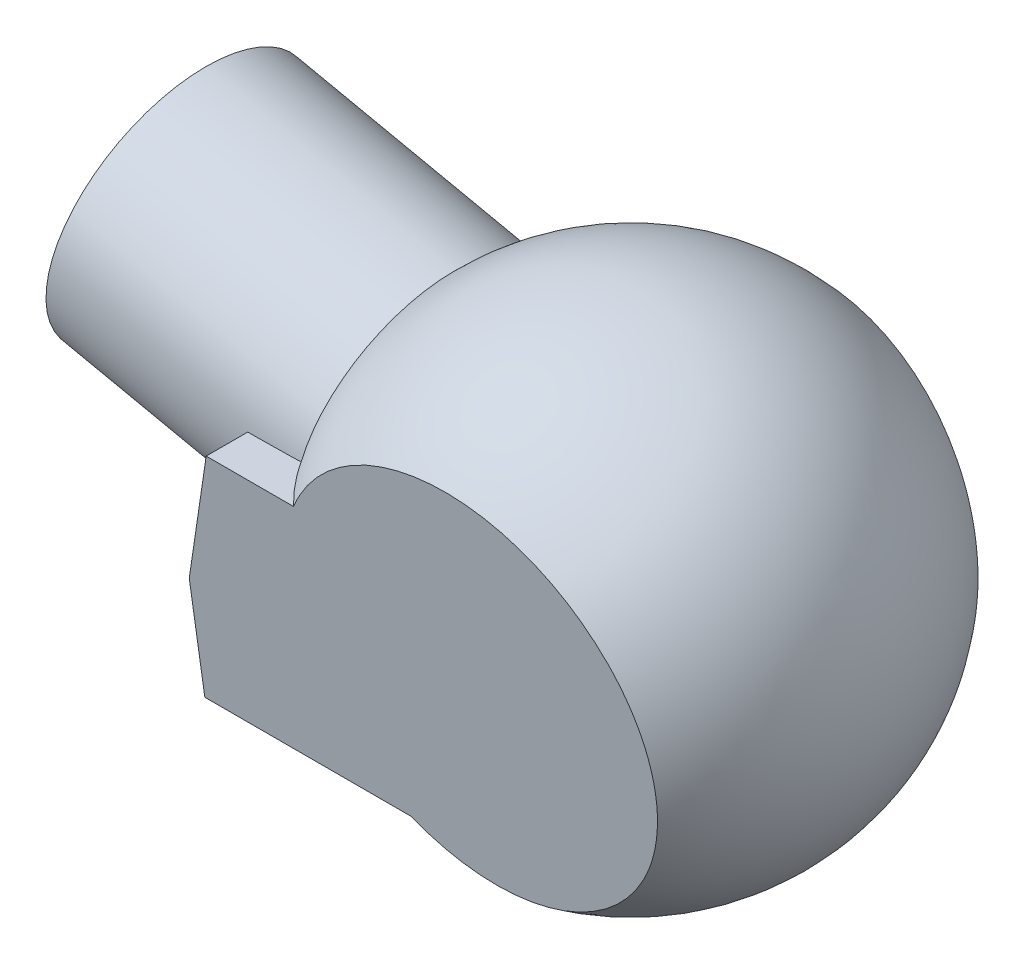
ISO-10303-21;
HEADER;
FILE_DESCRIPTION(('STEP AP214'),'2;1');
FILE_NAME('part.step','',(''),(''),'','','');
FILE_SCHEMA(('AUTOMOTIVE_DESIGN { 1 0 10303 214 1 1 1 1 }'));
ENDSEC;
DATA;
#1=APPLICATION_CONTEXT('core data for automotive mechanical design processes');
#2=APPLICATION_PROTOCOL_DEFINITION('international standard','automotive_design',2000,#1);
#3=PRODUCT_CONTEXT('',#1,'mechanical');
#4=PRODUCT('Part','Part','',(#3));
#5=PRODUCT_RELATED_PRODUCT_CATEGORY('part','',(#4));
#6=PRODUCT_DEFINITION_FORMATION('','',#4);
#7=PRODUCT_DEFINITION_CONTEXT('part definition',#1,'design');
#8=PRODUCT_DEFINITION('design','',#6,#7);
#9=PRODUCT_DEFINITION_SHAPE('','',#8);
#10=(LENGTH_UNIT() NAMED_UNIT(*) SI_UNIT(.MILLI.,.METRE.));
#11=(NAMED_UNIT(*) PLANE_ANGLE_UNIT() SI_UNIT($,.RADIAN.));
#12=(NAMED_UNIT(*) SI_UNIT($,.STERADIAN.) SOLID_ANGLE_UNIT());
#13=UNCERTAINTY_MEASURE_WITH_UNIT(LENGTH_MEASURE(1.E-05),#10,'distance_accuracy_value','');
#14=(GEOMETRIC_REPRESENTATION_CONTEXT(3) GLOBAL_UNCERTAINTY_ASSIGNED_CONTEXT((#13)) GLOBAL_UNIT_ASSIGNED_CONTEXT((#10,
#11,#12)) REPRESENTATION_CONTEXT('',''));
#15=CARTESIAN_POINT('',(0.,0.,0.));
#16=DIRECTION('',(0.,0.,1.));
#17=DIRECTION('',(1.,0.,0.));
#18=AXIS2_PLACEMENT_3D('',#15,#16,#17);
#19=CARTESIAN_POINT('',(-127.,25.4,75.3842872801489));
#20=DIRECTION('',(0.,1.,0.));
#21=DIRECTION('',(0.,0.,1.));
#22=AXIS2_PLACEMENT_3D('',#19,#20,#21);
#23=PLANE('',#22);
#24=CARTESIAN_POINT('',(-119.497604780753,25.4,0.));
#25=DIRECTION('',(0.,1.,0.));
#26=DIRECTION('',(1.,0.,0.));
#27=AXIS2_PLACEMENT_3D('',#24,#25,#26);
#28=ELLIPSE('',#27,274.876317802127,57.15);
#29=CARTESIAN_POINT('',(-88.2280398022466,25.4,-56.779005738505));
#30=VERTEX_POINT('',#29);
#31=CARTESIAN_POINT('',(-111.346408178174,25.4,-57.1248666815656));
#32=VERTEX_POINT('',#31);
#33=EDGE_CURVE('E58',#30,#32,#28,.T.);
#34=ORIENTED_EDGE('',*,*,#33,.F.);
#35=CARTESIAN_POINT('',(0.,25.4,0.));
#36=DIRECTION('',(0.,1.,0.));
#37=DIRECTION('',(0.,0.,1.));
#38=AXIS2_PLACEMENT_3D('',#35,#36,#37);
#39=CIRCLE('',#38,104.9192189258);
#40=CARTESIAN_POINT('',(-72.9743224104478,25.4,-75.3842872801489));
#41=VERTEX_POINT('',#40);
#42=EDGE_CURVE('E128',#41,#30,#39,.T.);
#43=ORIENTED_EDGE('',*,*,#42,.F.);
#44=DIRECTION('',(1.,0.,0.));
#45=VECTOR('',#44,1.);
#46=CARTESIAN_POINT('',(-127.,25.4,-75.3842872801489));
#47=LINE('',#46,#45);
#48=CARTESIAN_POINT('',(-111.346408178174,25.4,-75.3842872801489));
#49=VERTEX_POINT('',#48);
#50=EDGE_CURVE('E136',#49,#41,#47,.T.);
#51=ORIENTED_EDGE('',*,*,#50,.F.);
#52=DIRECTION('',(0.,0.,1.));
#53=VECTOR('',#52,1.);
#54=CARTESIAN_POINT('',(-111.346408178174,25.4,75.3842872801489));
#55=LINE('',#54,#53);
#56=EDGE_CURVE('E161',#49,#32,#55,.T.);
#57=ORIENTED_EDGE('',*,*,#56,.T.);
#58=EDGE_LOOP('',(#34,#43,#51,#57));
#59=FACE_BOUND('',#58,.T.);
#60=ADVANCED_FACE('F35',(#59),#23,.T.);
#61=CARTESIAN_POINT('',(-127.,25.4,75.3842872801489));
#62=DIRECTION('',(0.,-0.139173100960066,0.99026806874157));
#63=DIRECTION('',(0.,-0.99026806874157,-0.139173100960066));
#64=AXIS2_PLACEMENT_3D('',#61,#62,#63);
#65=PLANE('',#64);
#66=DIRECTION('',(1.,0.,0.));
#67=VECTOR('',#66,1.);
#68=CARTESIAN_POINT('',(-127.,25.4,75.3842872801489));
#69=LINE('',#68,#67);
#70=CARTESIAN_POINT('',(-111.346408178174,25.4,75.3842872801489));
#71=VERTEX_POINT('',#70);
#72=CARTESIAN_POINT('',(-72.9743224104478,25.4,75.3842872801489));
#73=VERTEX_POINT('',#72);
#74=EDGE_CURVE('E141',#71,#73,#69,.T.);
#75=ORIENTED_EDGE('',*,*,#74,.F.);
#76=DIRECTION('',(-0.256466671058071,-0.957146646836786,-0.134518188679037));
#77=VECTOR('',#76,1.);
#78=CARTESIAN_POINT('',(-112.376025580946,21.5574155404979,74.844247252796));
#79=LINE('',#78,#77);
#80=CARTESIAN_POINT('',(-127.,-33.0200000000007,67.173891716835));
#81=VERTEX_POINT('',#80);
#82=EDGE_CURVE('E163',#71,#81,#79,.T.);
#83=ORIENTED_EDGE('',*,*,#82,.T.);
#84=DIRECTION('',(0.,-0.99026806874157,-0.139173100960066));
#85=VECTOR('',#84,1.);
#86=CARTESIAN_POINT('',(-127.,25.4,75.3842872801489));
#87=LINE('',#86,#85);
#88=CARTESIAN_POINT('',(-127.,-81.7523967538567,60.325));
#89=VERTEX_POINT('',#88);
#90=EDGE_CURVE('E174',#81,#89,#87,.T.);
#91=ORIENTED_EDGE('',*,*,#90,.T.);
#92=DIRECTION('',(1.,0.,0.));
#93=VECTOR('',#92,1.);
#94=CARTESIAN_POINT('',(-127.,-81.7523967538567,60.325));
#95=LINE('',#94,#93);
#96=CARTESIAN_POINT('',(-36.4779728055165,-81.7523967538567,60.325));
#97=VERTEX_POINT('',#96);
#98=EDGE_CURVE('E177',#89,#97,#95,.T.);
#99=ORIENTED_EDGE('',*,*,#98,.T.);
#100=CARTESIAN_POINT('',(0.,-9.8973863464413,70.4235631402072));
#101=DIRECTION('',(0.,0.139173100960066,-0.99026806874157));
#102=DIRECTION('',(0.,0.99026806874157,0.139173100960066));
#103=AXIS2_PLACEMENT_3D('',#100,#101,#102);
#104=CIRCLE('',#103,81.2143213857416);
#105=EDGE_CURVE('E133',#73,#97,#104,.T.);
#106=ORIENTED_EDGE('',*,*,#105,.F.);
#107=EDGE_LOOP('',(#75,#83,#91,#99,#106));
#108=FACE_BOUND('',#107,.T.);
#109=ADVANCED_FACE('F225',(#108),#65,.T.);
#110=CARTESIAN_POINT('',(-111.346408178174,25.4,57.1248666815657));
#111=VERTEX_POINT('',#110);
#112=CARTESIAN_POINT('',(-88.2280398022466,25.4,56.779005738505));
#113=VERTEX_POINT('',#112);
#114=EDGE_CURVE('E183',#111,#113,#28,.T.);
#115=ORIENTED_EDGE('',*,*,#114,.F.);
#116=EDGE_CURVE('E160',#111,#71,#55,.T.);
#117=ORIENTED_EDGE('',*,*,#116,.T.);
#118=ORIENTED_EDGE('',*,*,#74,.T.);
#119=EDGE_CURVE('E145',#113,#73,#39,.T.);
#120=ORIENTED_EDGE('',*,*,#119,.F.);
#121=EDGE_LOOP('',(#115,#117,#118,#120));
#122=FACE_BOUND('',#121,.T.);
#123=ADVANCED_FACE('F244',(#122),#23,.T.);
#124=CARTESIAN_POINT('',(-127.,25.4,-75.3842872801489));
#125=DIRECTION('',(0.,-0.139173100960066,-0.99026806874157));
#126=DIRECTION('',(0.,0.99026806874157,-0.139173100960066));
#127=AXIS2_PLACEMENT_3D('',#124,#125,#126);
#128=PLANE('',#127);
#129=DIRECTION('',(0.,0.99026806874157,-0.139173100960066));
#130=VECTOR('',#129,1.);
#131=CARTESIAN_POINT('',(-127.,25.4,-75.3842872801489));
#132=LINE('',#131,#130);
#133=CARTESIAN_POINT('',(-127.,-81.7523967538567,-60.325));
#134=VERTEX_POINT('',#133);
#135=CARTESIAN_POINT('',(-127.,-33.0200000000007,-67.173891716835));
#136=VERTEX_POINT('',#135);
#137=EDGE_CURVE('E172',#134,#136,#132,.T.);
#138=ORIENTED_EDGE('',*,*,#137,.T.);
#139=DIRECTION('',(0.256466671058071,0.957146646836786,-0.134518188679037));
#140=VECTOR('',#139,1.);
#141=CARTESIAN_POINT('',(-112.376025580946,21.5574155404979,-74.844247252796));
#142=LINE('',#141,#140);
#143=EDGE_CURVE('E43',#136,#49,#142,.T.);
#144=ORIENTED_EDGE('',*,*,#143,.T.);
#145=ORIENTED_EDGE('',*,*,#50,.T.);
#146=CARTESIAN_POINT('',(0.,-9.8973863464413,-70.4235631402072));
#147=DIRECTION('',(0.,0.139173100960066,0.99026806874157));
#148=DIRECTION('',(0.,-0.99026806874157,0.139173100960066));
#149=AXIS2_PLACEMENT_3D('',#146,#147,#148);
#150=CIRCLE('',#149,81.2143213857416);
#151=CARTESIAN_POINT('',(-36.4779728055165,-81.7523967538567,-60.325));
#152=VERTEX_POINT('',#151);
#153=EDGE_CURVE('E125',#152,#41,#150,.T.);
#154=ORIENTED_EDGE('',*,*,#153,.F.);
#155=DIRECTION('',(1.,0.,0.));
#156=VECTOR('',#155,1.);
#157=CARTESIAN_POINT('',(-127.,-81.7523967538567,-60.325));
#158=LINE('',#157,#156);
#159=EDGE_CURVE('E142',#134,#152,#158,.T.);
#160=ORIENTED_EDGE('',*,*,#159,.F.);
#161=EDGE_LOOP('',(#138,#144,#145,#154,#160));
#162=FACE_BOUND('',#161,.T.);
#163=ADVANCED_FACE('F138',(#162),#128,.T.);
#164=CARTESIAN_POINT('',(-127.,0.,0.));
#165=DIRECTION('',(1.,0.,0.));
#166=DIRECTION('',(0.,0.,-1.));
#167=AXIS2_PLACEMENT_3D('',#164,#165,#166);
#168=CYLINDRICAL_SURFACE('',#167,101.6);
#169=DIRECTION('',(1.,0.,0.));
#170=VECTOR('',#169,1.);
#171=CARTESIAN_POINT('',(-127.,-100.803124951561,-12.7));
#172=LINE('',#171,#170);
#173=CARTESIAN_POINT('',(-50.8,-100.803124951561,-12.7));
#174=VERTEX_POINT('',#173);
#175=CARTESIAN_POINT('',(-36.4779728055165,-100.803124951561,-12.7));
#176=VERTEX_POINT('',#175);
#177=EDGE_CURVE('E214',#174,#176,#172,.T.);
#178=ORIENTED_EDGE('',*,*,#177,.F.);
#179=CARTESIAN_POINT('',(-50.8,0.,0.));
#180=DIRECTION('',(-1.,0.,0.));
#181=DIRECTION('',(0.,0.,1.));
#182=AXIS2_PLACEMENT_3D('',#179,#180,#181);
#183=CIRCLE('',#182,101.6);
#184=CARTESIAN_POINT('',(-50.8,-100.803124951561,12.7));
#185=VERTEX_POINT('',#184);
#186=EDGE_CURVE('E157',#185,#174,#183,.F.);
#187=ORIENTED_EDGE('',*,*,#186,.F.);
#188=DIRECTION('',(1.,0.,0.));
#189=VECTOR('',#188,1.);
#190=CARTESIAN_POINT('',(-127.,-100.803124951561,12.7));
#191=LINE('',#190,#189);
#192=CARTESIAN_POINT('',(-36.4779728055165,-100.803124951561,12.7));
#193=VERTEX_POINT('',#192);
#194=EDGE_CURVE('E209',#185,#193,#191,.T.);
#195=ORIENTED_EDGE('',*,*,#194,.T.);
#196=CARTESIAN_POINT('',(-36.4779728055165,0.,0.));
#197=DIRECTION('',(1.,0.,0.));
#198=DIRECTION('',(0.,0.,-1.));
#199=AXIS2_PLACEMENT_3D('',#196,#197,#198);
#200=CIRCLE('',#199,101.6);
#201=EDGE_CURVE('E150',#97,#193,#200,.T.);
#202=ORIENTED_EDGE('',*,*,#201,.F.);
#203=ORIENTED_EDGE('',*,*,#98,.F.);
#204=CARTESIAN_POINT('',(-127.,0.,0.));
#205=DIRECTION('',(1.,0.,0.));
#206=DIRECTION('',(0.,0.,-1.));
#207=AXIS2_PLACEMENT_3D('',#204,#205,#206);
#208=CIRCLE('',#207,101.6);
#209=EDGE_CURVE('E178',#89,#134,#208,.T.);
#210=ORIENTED_EDGE('',*,*,#209,.T.);
#211=ORIENTED_EDGE('',*,*,#159,.T.);
#212=EDGE_CURVE('E130',#176,#152,#200,.T.);
#213=ORIENTED_EDGE('',*,*,#212,.F.);
#214=EDGE_LOOP('',(#178,#187,#195,#202,#203,#210,#211,#213));
#215=FACE_BOUND('',#214,.T.);
#216=ADVANCED_FACE('F228',(#215),#168,.T.);
#217=CARTESIAN_POINT('',(-127.,0.,0.));
#218=DIRECTION('',(1.,0.,0.));
#219=DIRECTION('',(0.,0.,-1.));
#220=AXIS2_PLACEMENT_3D('',#217,#218,#219);
#221=PLANE('',#220);
#222=ORIENTED_EDGE('',*,*,#90,.F.);
#223=DIRECTION('',(0.,0.,-1.));
#224=VECTOR('',#223,1.);
#225=CARTESIAN_POINT('',(-127.,-33.0200000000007,-75.3842872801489));
#226=LINE('',#225,#224);
#227=EDGE_CURVE('E165',#81,#136,#226,.T.);
#228=ORIENTED_EDGE('',*,*,#227,.T.);
#229=ORIENTED_EDGE('',*,*,#137,.F.);
#230=ORIENTED_EDGE('',*,*,#209,.F.);
#231=EDGE_LOOP('',(#222,#228,#229,#230));
#232=FACE_BOUND('',#231,.T.);
#233=ADVANCED_FACE('F170',(#232),#221,.F.);
#234=CARTESIAN_POINT('',(0.,0.,0.));
#235=DIRECTION('',(-1.,0.,0.));
#236=DIRECTION('',(0.,1.,0.));
#237=AXIS2_PLACEMENT_3D('',#234,#235,#236);
#238=SPHERICAL_SURFACE('',#237,107.95);
#239=ORIENTED_EDGE('',*,*,#212,.T.);
#240=ORIENTED_EDGE('',*,*,#153,.T.);
#241=ORIENTED_EDGE('',*,*,#42,.T.);
#242=CARTESIAN_POINT('',(-89.5797377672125,19.0407610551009,0.));
#243=DIRECTION('',(0.978147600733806,-0.20791169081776,0.));
#244=DIRECTION('',(0.20791169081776,0.978147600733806,0.));
#245=AXIS2_PLACEMENT_3D('',#242,#243,#244);
#246=CIRCLE('',#245,57.15);
#247=EDGE_CURVE('E50',#30,#113,#246,.T.);
#248=ORIENTED_EDGE('',*,*,#247,.T.);
#249=ORIENTED_EDGE('',*,*,#119,.T.);
#250=ORIENTED_EDGE('',*,*,#105,.T.);
#251=ORIENTED_EDGE('',*,*,#201,.T.);
#252=CARTESIAN_POINT('',(0.,0.,12.7));
#253=DIRECTION('',(0.,0.,-1.));
#254=DIRECTION('',(-1.,0.,0.));
#255=AXIS2_PLACEMENT_3D('',#252,#253,#254);
#256=CIRCLE('',#255,107.200338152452);
#257=CARTESIAN_POINT('',(-3.17122908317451,-107.153421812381,12.7));
#258=VERTEX_POINT('',#257);
#259=EDGE_CURVE('E144',#258,#193,#256,.T.);
#260=ORIENTED_EDGE('',*,*,#259,.F.);
#261=CARTESIAN_POINT('',(50.292,-67.056,0.));
#262=DIRECTION('',(0.6,-0.8,0.));
#263=DIRECTION('',(0.8,0.6,0.));
#264=AXIS2_PLACEMENT_3D('',#261,#262,#263);
#265=CIRCLE('',#264,68.0250696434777);
#266=CARTESIAN_POINT('',(-3.17122908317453,-107.153421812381,-12.7));
#267=VERTEX_POINT('',#266);
#268=EDGE_CURVE('E148',#258,#267,#265,.T.);
#269=ORIENTED_EDGE('',*,*,#268,.T.);
#270=CARTESIAN_POINT('',(0.,0.,-12.7));
#271=DIRECTION('',(0.,0.,-1.));
#272=DIRECTION('',(-1.,0.,0.));
#273=AXIS2_PLACEMENT_3D('',#270,#271,#272);
#274=CIRCLE('',#273,107.200338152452);
#275=EDGE_CURVE('E155',#267,#176,#274,.T.);
#276=ORIENTED_EDGE('',*,*,#275,.T.);
#277=EDGE_LOOP('',(#239,#240,#241,#248,#249,#250,#251,#260,#269,#276));
#278=FACE_BOUND('',#277,.T.);
#279=ADVANCED_FACE('F127',(#278),#238,.T.);
#280=CARTESIAN_POINT('',(12.7,-95.25,-12.7));
#281=DIRECTION('',(0.6,-0.8,0.));
#282=DIRECTION('',(0.8,0.6,0.));
#283=AXIS2_PLACEMENT_3D('',#280,#281,#282);
#284=PLANE('',#283);
#285=ORIENTED_EDGE('',*,*,#268,.F.);
#286=DIRECTION('',(0.8,0.6,0.));
#287=VECTOR('',#286,1.);
#288=CARTESIAN_POINT('',(12.7,-95.25,12.7));
#289=LINE('',#288,#287);
#290=CARTESIAN_POINT('',(-35.56,-131.445,12.7));
#291=VERTEX_POINT('',#290);
#292=EDGE_CURVE('E194',#291,#258,#289,.T.);
#293=ORIENTED_EDGE('',*,*,#292,.F.);
#294=DIRECTION('',(0.,0.,1.));
#295=VECTOR('',#294,1.);
#296=CARTESIAN_POINT('',(-35.56,-131.445,-12.7));
#297=LINE('',#296,#295);
#298=CARTESIAN_POINT('',(-35.56,-131.445,-12.7));
#299=VERTEX_POINT('',#298);
#300=EDGE_CURVE('E207',#299,#291,#297,.T.);
#301=ORIENTED_EDGE('',*,*,#300,.F.);
#302=DIRECTION('',(0.8,0.6,0.));
#303=VECTOR('',#302,1.);
#304=CARTESIAN_POINT('',(12.7,-95.25,-12.7));
#305=LINE('',#304,#303);
#306=EDGE_CURVE('E197',#299,#267,#305,.T.);
#307=ORIENTED_EDGE('',*,*,#306,.T.);
#308=EDGE_LOOP('',(#285,#293,#301,#307));
#309=FACE_BOUND('',#308,.T.);
#310=ADVANCED_FACE('F262',(#309),#284,.T.);
#311=CARTESIAN_POINT('',(-41.275,-123.825,-12.7));
#312=DIRECTION('',(0.,0.,1.));
#313=DIRECTION('',(1.,0.,0.));
#314=AXIS2_PLACEMENT_3D('',#311,#312,#313);
#315=CYLINDRICAL_SURFACE('',#314,9.525);
#316=CARTESIAN_POINT('',(-41.275,-123.825,12.7));
#317=DIRECTION('',(0.,0.,1.));
#318=DIRECTION('',(-1.,0.,0.));
#319=AXIS2_PLACEMENT_3D('',#316,#317,#318);
#320=CIRCLE('',#319,9.525);
#321=CARTESIAN_POINT('',(-50.8,-123.825,12.7));
#322=VERTEX_POINT('',#321);
#323=EDGE_CURVE('E202',#322,#291,#320,.T.);
#324=ORIENTED_EDGE('',*,*,#323,.F.);
#325=DIRECTION('',(0.,0.,1.));
#326=VECTOR('',#325,1.);
#327=CARTESIAN_POINT('',(-50.8,-123.825,-12.7));
#328=LINE('',#327,#326);
#329=CARTESIAN_POINT('',(-50.8,-123.825,-12.7));
#330=VERTEX_POINT('',#329);
#331=EDGE_CURVE('E200',#330,#322,#328,.T.);
#332=ORIENTED_EDGE('',*,*,#331,.F.);
#333=CARTESIAN_POINT('',(-41.275,-123.825,-12.7));
#334=DIRECTION('',(0.,0.,1.));
#335=DIRECTION('',(-1.,0.,0.));
#336=AXIS2_PLACEMENT_3D('',#333,#334,#335);
#337=CIRCLE('',#336,9.525);
#338=EDGE_CURVE('E193',#330,#299,#337,.T.);
#339=ORIENTED_EDGE('',*,*,#338,.T.);
#340=ORIENTED_EDGE('',*,*,#300,.T.);
#341=EDGE_LOOP('',(#324,#332,#339,#340));
#342=FACE_BOUND('',#341,.T.);
#343=ADVANCED_FACE('F267',(#342),#315,.T.);
#344=CARTESIAN_POINT('',(-50.8,-123.825,-12.7));
#345=DIRECTION('',(-1.,0.,0.));
#346=DIRECTION('',(0.,0.,1.));
#347=AXIS2_PLACEMENT_3D('',#344,#345,#346);
#348=PLANE('',#347);
#349=DIRECTION('',(0.,-1.,0.));
#350=VECTOR('',#349,1.);
#351=CARTESIAN_POINT('',(-50.8,-123.825,12.7));
#352=LINE('',#351,#350);
#353=EDGE_CURVE('E185',#185,#322,#352,.T.);
#354=ORIENTED_EDGE('',*,*,#353,.F.);
#355=ORIENTED_EDGE('',*,*,#186,.T.);
#356=DIRECTION('',(0.,-1.,0.));
#357=VECTOR('',#356,1.);
#358=CARTESIAN_POINT('',(-50.8,-123.825,-12.7));
#359=LINE('',#358,#357);
#360=EDGE_CURVE('E191',#174,#330,#359,.T.);
#361=ORIENTED_EDGE('',*,*,#360,.T.);
#362=ORIENTED_EDGE('',*,*,#331,.T.);
#363=EDGE_LOOP('',(#354,#355,#361,#362));
#364=FACE_BOUND('',#363,.T.);
#365=ADVANCED_FACE('F273',(#364),#348,.T.);
#366=CARTESIAN_POINT('',(-41.275,-123.825,-12.7));
#367=DIRECTION('',(0.,0.,-1.));
#368=DIRECTION('',(-1.,0.,0.));
#369=AXIS2_PLACEMENT_3D('',#366,#367,#368);
#370=PLANE('',#369);
#371=ORIENTED_EDGE('',*,*,#360,.F.);
#372=ORIENTED_EDGE('',*,*,#177,.T.);
#373=ORIENTED_EDGE('',*,*,#275,.F.);
#374=ORIENTED_EDGE('',*,*,#306,.F.);
#375=ORIENTED_EDGE('',*,*,#338,.F.);
#376=EDGE_LOOP('',(#371,#372,#373,#374,#375));
#377=FACE_BOUND('',#376,.T.);
#378=ADVANCED_FACE('F276',(#377),#370,.T.);
#379=CARTESIAN_POINT('',(-41.275,-123.825,12.7));
#380=DIRECTION('',(0.,0.,-1.));
#381=DIRECTION('',(-1.,0.,0.));
#382=AXIS2_PLACEMENT_3D('',#379,#380,#381);
#383=PLANE('',#382);
#384=ORIENTED_EDGE('',*,*,#194,.F.);
#385=ORIENTED_EDGE('',*,*,#353,.T.);
#386=ORIENTED_EDGE('',*,*,#323,.T.);
#387=ORIENTED_EDGE('',*,*,#292,.T.);
#388=ORIENTED_EDGE('',*,*,#259,.T.);
#389=EDGE_LOOP('',(#384,#385,#386,#387,#388));
#390=FACE_BOUND('',#389,.T.);
#391=ADVANCED_FACE('F281',(#390),#383,.F.);
#392=CARTESIAN_POINT('',(-111.346408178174,25.4,75.3842872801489));
#393=DIRECTION('',(-0.965925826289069,0.258819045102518,0.));
#394=DIRECTION('',(-0.258819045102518,-0.965925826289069,0.));
#395=AXIS2_PLACEMENT_3D('',#392,#393,#394);
#396=PLANE('',#395);
#397=CARTESIAN_POINT('',(-111.785638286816,23.7607709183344,0.));
#398=DIRECTION('',(-0.965925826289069,0.258819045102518,0.));
#399=DIRECTION('',(0.258819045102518,0.965925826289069,0.));
#400=AXIS2_PLACEMENT_3D('',#397,#398,#399);
#401=ELLIPSE('',#400,57.2284295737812,57.15);
#402=EDGE_CURVE('E11',#32,#111,#401,.T.);
#403=ORIENTED_EDGE('',*,*,#402,.F.);
#404=ORIENTED_EDGE('',*,*,#56,.F.);
#405=ORIENTED_EDGE('',*,*,#143,.F.);
#406=ORIENTED_EDGE('',*,*,#227,.F.);
#407=ORIENTED_EDGE('',*,*,#82,.F.);
#408=ORIENTED_EDGE('',*,*,#116,.F.);
#409=EDGE_LOOP('',(#403,#404,#405,#406,#407,#408));
#410=FACE_BOUND('',#409,.T.);
#411=ADVANCED_FACE('F37',(#410),#396,.T.);
#412=CARTESIAN_POINT('',(0.,0.,0.));
#413=DIRECTION('',(0.978147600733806,-0.20791169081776,0.));
#414=DIRECTION('',(0.20791169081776,0.978147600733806,0.));
#415=AXIS2_PLACEMENT_3D('',#412,#413,#414);
#416=CYLINDRICAL_SURFACE('',#415,57.15);
#417=CARTESIAN_POINT('',(-198.759592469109,42.2476555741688,0.));
#418=DIRECTION('',(0.978147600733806,-0.20791169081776,0.));
#419=DIRECTION('',(0.20791169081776,0.978147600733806,0.));
#420=AXIS2_PLACEMENT_3D('',#417,#418,#419);
#421=CIRCLE('',#420,57.15);
#422=CARTESIAN_POINT('',(-186.877439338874,98.1487909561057,0.));
#423=VERTEX_POINT('',#422);
#424=EDGE_CURVE('E187',#423,#423,#421,.T.);
#425=ORIENTED_EDGE('',*,*,#424,.T.);
#426=EDGE_LOOP('',(#425));
#427=FACE_BOUND('',#426,.T.);
#428=ORIENTED_EDGE('',*,*,#247,.F.);
#429=ORIENTED_EDGE('',*,*,#33,.T.);
#430=ORIENTED_EDGE('',*,*,#402,.T.);
#431=ORIENTED_EDGE('',*,*,#114,.T.);
#432=EDGE_LOOP('',(#428,#429,#430,#431));
#433=FACE_BOUND('',#432,.T.);
#434=ADVANCED_FACE('F181',(#427,#433),#416,.T.);
#435=CARTESIAN_POINT('',(-198.759592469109,42.2476555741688,0.));
#436=DIRECTION('',(-0.978147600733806,0.20791169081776,0.));
#437=DIRECTION('',(-0.20791169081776,-0.978147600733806,0.));
#438=AXIS2_PLACEMENT_3D('',#435,#436,#437);
#439=PLANE('',#438);
#440=ORIENTED_EDGE('',*,*,#424,.F.);
#441=EDGE_LOOP('',(#440));
#442=FACE_BOUND('',#441,.T.);
#443=ADVANCED_FACE('F235',(#442),#439,.T.);
#444=CLOSED_SHELL('',(#60,#109,#123,#163,#216,#233,#279,#310,#343,#365,#378,#391,#411,#434,#443));
#445=MANIFOLD_SOLID_BREP('B2',#444);
#446=ADVANCED_BREP_SHAPE_REPRESENTATION('',(#18,#445),#14);
#447=SHAPE_DEFINITION_REPRESENTATION(#9,#446);
ENDSEC;
END-ISO-10303-21;
